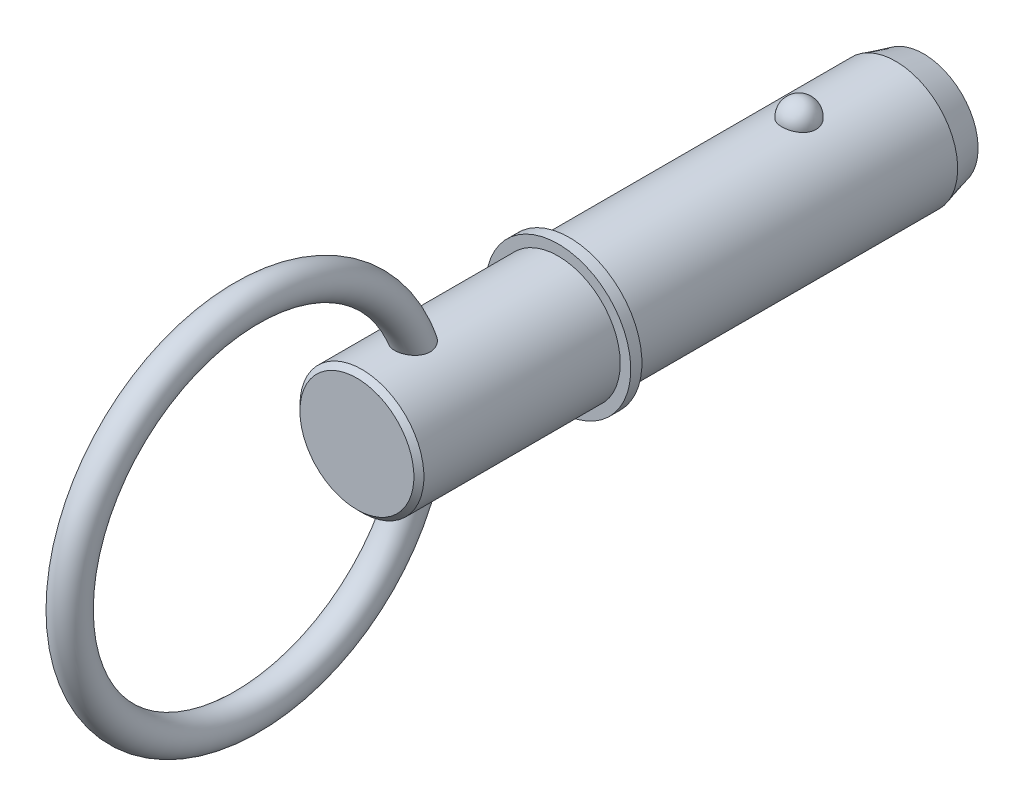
ISO-10303-21;
HEADER;
FILE_DESCRIPTION(('STEP AP214'),'2;1');
FILE_NAME('part.step','',(''),(''),'','','');
FILE_SCHEMA(('AUTOMOTIVE_DESIGN { 1 0 10303 214 1 1 1 1 }'));
ENDSEC;
DATA;
#1=APPLICATION_CONTEXT('core data for automotive mechanical design processes');
#2=APPLICATION_PROTOCOL_DEFINITION('international standard','automotive_design',2000,#1);
#3=PRODUCT_CONTEXT('',#1,'mechanical');
#4=PRODUCT('Part','Part','',(#3));
#5=PRODUCT_RELATED_PRODUCT_CATEGORY('part','',(#4));
#6=PRODUCT_DEFINITION_FORMATION('','',#4);
#7=PRODUCT_DEFINITION_CONTEXT('part definition',#1,'design');
#8=PRODUCT_DEFINITION('design','',#6,#7);
#9=PRODUCT_DEFINITION_SHAPE('','',#8);
#10=(LENGTH_UNIT() NAMED_UNIT(*) SI_UNIT(.MILLI.,.METRE.));
#11=(NAMED_UNIT(*) PLANE_ANGLE_UNIT() SI_UNIT($,.RADIAN.));
#12=(NAMED_UNIT(*) SI_UNIT($,.STERADIAN.) SOLID_ANGLE_UNIT());
#13=UNCERTAINTY_MEASURE_WITH_UNIT(LENGTH_MEASURE(1.E-05),#10,'distance_accuracy_value','');
#14=(GEOMETRIC_REPRESENTATION_CONTEXT(3) GLOBAL_UNCERTAINTY_ASSIGNED_CONTEXT((#13)) GLOBAL_UNIT_ASSIGNED_CONTEXT((#10,
#11,#12)) REPRESENTATION_CONTEXT('',''));
#15=CARTESIAN_POINT('',(0.,0.,0.));
#16=DIRECTION('',(0.,0.,1.));
#17=DIRECTION('',(1.,0.,0.));
#18=AXIS2_PLACEMENT_3D('',#15,#16,#17);
#19=CARTESIAN_POINT('',(0.,0.,38.1));
#20=DIRECTION('',(0.,0.,-1.));
#21=DIRECTION('',(-1.,0.,0.));
#22=AXIS2_PLACEMENT_3D('',#19,#20,#21);
#23=CYLINDRICAL_SURFACE('',#22,11.115);
#24=CARTESIAN_POINT('',(3.04058343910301,10.6910278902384,-3.07));
#25=CARTESIAN_POINT('',(3.04058039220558,10.6910304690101,-2.89837124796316));
#26=CARTESIAN_POINT('',(3.02657193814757,10.6950430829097,-2.72670368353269));
#27=CARTESIAN_POINT('',(2.97087341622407,10.7106465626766,-2.38822964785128));
#28=CARTESIAN_POINT('',(2.92917240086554,10.7222404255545,-2.22142512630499));
#29=CARTESIAN_POINT('',(2.81915317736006,10.751689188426,-1.89750816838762));
#30=CARTESIAN_POINT('',(2.75084669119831,10.7695413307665,-1.7403914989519));
#31=CARTESIAN_POINT('',(2.58932284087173,10.809510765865,-1.44013959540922));
#32=CARTESIAN_POINT('',(2.49610617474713,10.8316279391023,-1.29700396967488));
#33=CARTESIAN_POINT('',(2.28659317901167,10.877786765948,-1.02797591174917));
#34=CARTESIAN_POINT('',(2.17018825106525,10.9018371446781,-0.902169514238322));
#35=CARTESIAN_POINT('',(1.91759004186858,10.9490888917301,-0.67209160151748));
#36=CARTESIAN_POINT('',(1.78139672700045,10.9722902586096,-0.567820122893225));
#37=CARTESIAN_POINT('',(1.49327884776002,11.0151925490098,-0.383992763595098));
#38=CARTESIAN_POINT('',(1.34139928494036,11.034903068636,-0.304368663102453));
#39=CARTESIAN_POINT('',(1.0258482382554,11.0686948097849,-0.17173147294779));
#40=CARTESIAN_POINT('',(0.862178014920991,11.0827766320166,-0.118715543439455));
#41=CARTESIAN_POINT('',(0.530748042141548,11.1035404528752,-0.0415304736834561));
#42=CARTESIAN_POINT('',(0.363109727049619,11.1103474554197,-0.0168734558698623));
#43=CARTESIAN_POINT('',(0.0259327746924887,11.1162480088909,0.00453486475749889));
#44=CARTESIAN_POINT('',(-0.143605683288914,11.1153422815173,0.00128877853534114));
#45=CARTESIAN_POINT('',(-0.477280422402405,11.1059854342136,-0.0327676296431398));
#46=CARTESIAN_POINT('',(-0.6414590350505,11.0976393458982,-0.0631942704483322));
#47=CARTESIAN_POINT('',(-0.962236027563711,11.0744390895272,-0.150220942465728));
#48=CARTESIAN_POINT('',(-1.11883427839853,11.0595848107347,-0.206821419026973));
#49=CARTESIAN_POINT('',(-1.42104610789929,11.0248420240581,-0.34502889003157));
#50=CARTESIAN_POINT('',(-1.56659244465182,11.0049254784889,-0.426775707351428));
#51=CARTESIAN_POINT('',(-1.8418931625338,10.9622119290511,-0.612956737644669));
#52=CARTESIAN_POINT('',(-1.97164597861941,10.9394146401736,-0.717393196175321));
#53=CARTESIAN_POINT('',(-2.21432263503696,10.8929139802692,-0.948332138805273));
#54=CARTESIAN_POINT('',(-2.32688909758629,10.8692016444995,-1.07520847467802));
#55=CARTESIAN_POINT('',(-2.52940007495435,10.8238699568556,-1.34622145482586));
#56=CARTESIAN_POINT('',(-2.6193430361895,10.8022507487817,-1.49035928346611));
#57=CARTESIAN_POINT('',(-2.77523958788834,10.7632629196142,-1.79367507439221));
#58=CARTESIAN_POINT('',(-2.8409151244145,10.7459442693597,-1.95300253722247));
#59=CARTESIAN_POINT('',(-2.94519180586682,10.7178360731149,-2.28083009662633));
#60=CARTESIAN_POINT('',(-2.98379371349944,10.707046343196,-2.44932993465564));
#61=CARTESIAN_POINT('',(-3.03284665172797,10.6932559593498,-2.78998091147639));
#62=CARTESIAN_POINT('',(-3.04341313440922,10.6902233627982,-2.96211412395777));
#63=CARTESIAN_POINT('',(-3.03646037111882,10.6922002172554,-3.305762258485));
#64=CARTESIAN_POINT('',(-3.0189418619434,10.6972094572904,-3.47727719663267));
#65=CARTESIAN_POINT('',(-2.95641582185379,10.7146564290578,-3.81396465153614));
#66=CARTESIAN_POINT('',(-2.91154117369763,10.7270582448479,-3.97916375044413));
#67=CARTESIAN_POINT('',(-2.79553341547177,10.7578713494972,-4.29947360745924));
#68=CARTESIAN_POINT('',(-2.72439927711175,10.7762828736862,-4.45458397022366));
#69=CARTESIAN_POINT('',(-2.55718900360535,10.8171819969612,-4.75123550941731));
#70=CARTESIAN_POINT('',(-2.46098224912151,10.8396907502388,-4.89270014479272));
#71=CARTESIAN_POINT('',(-2.24623042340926,10.8862165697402,-5.15724095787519));
#72=CARTESIAN_POINT('',(-2.12768452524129,10.9102336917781,-5.28031645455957));
#73=CARTESIAN_POINT('',(-1.87085107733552,10.9571990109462,-5.5050961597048));
#74=CARTESIAN_POINT('',(-1.73249451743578,10.9801430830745,-5.60672245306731));
#75=CARTESIAN_POINT('',(-1.44010079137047,11.0223008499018,-5.78517789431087));
#76=CARTESIAN_POINT('',(-1.28606470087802,11.0415148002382,-5.86200874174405));
#77=CARTESIAN_POINT('',(-0.968615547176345,11.0738491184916,-5.98788441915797));
#78=CARTESIAN_POINT('',(-0.805339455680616,11.0870408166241,-6.03725610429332));
#79=CARTESIAN_POINT('',(-0.472449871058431,11.1062048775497,-6.10820004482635));
#80=CARTESIAN_POINT('',(-0.302837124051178,11.11217808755,-6.1297755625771));
#81=CARTESIAN_POINT('',(0.034576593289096,11.1162034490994,-6.1443619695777));
#82=CARTESIAN_POINT('',(0.202353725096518,11.1143988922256,-6.13788957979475));
#83=CARTESIAN_POINT('',(0.534364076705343,11.103390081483,-6.09773981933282));
#84=CARTESIAN_POINT('',(0.698597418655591,11.094186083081,-6.06406338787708));
#85=CARTESIAN_POINT('',(1.01830314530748,11.0694136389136,-5.97063285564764));
#86=CARTESIAN_POINT('',(1.17380497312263,11.0538682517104,-5.91097318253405));
#87=CARTESIAN_POINT('',(1.472484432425,11.0180608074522,-5.76723645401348));
#88=CARTESIAN_POINT('',(1.6156613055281,10.9977984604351,-5.68315789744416));
#89=CARTESIAN_POINT('',(1.88801614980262,10.9543574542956,-5.49138807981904));
#90=CARTESIAN_POINT('',(2.01695079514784,10.9311394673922,-5.38336024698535));
#91=CARTESIAN_POINT('',(2.25501495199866,10.8845248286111,-5.14733839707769));
#92=CARTESIAN_POINT('',(2.36414099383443,10.8611281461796,-5.01934088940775));
#93=CARTESIAN_POINT('',(2.56152595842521,10.8162958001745,-4.74447932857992));
#94=CARTESIAN_POINT('',(2.64940088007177,10.7948999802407,-4.59733288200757));
#95=CARTESIAN_POINT('',(2.79961494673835,10.7569242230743,-4.29001203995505));
#96=CARTESIAN_POINT('',(2.86196390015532,10.7403424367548,-4.12984267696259));
#97=CARTESIAN_POINT('',(2.95377333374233,10.715429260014,-3.82062342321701));
#98=CARTESIAN_POINT('',(2.98627018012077,10.7063495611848,-3.67252681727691));
#99=CARTESIAN_POINT('',(3.02967634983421,10.6941478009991,-3.37296350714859));
#100=CARTESIAN_POINT('',(3.04058612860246,10.6910256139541,-3.2214968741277));
#101=CARTESIAN_POINT('',(3.04058343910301,10.6910278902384,-3.07));
#102=B_SPLINE_CURVE_WITH_KNOTS('',3,(#24,#25,#26,#27,#28,#29,#30,#31,#32,#33,#34,#35,#36,#37,
#38,#39,#40,#41,#42,#43,#44,#45,#46,#47,#48,#49,#50,#51,#52,#53,#54,#55,#56,#57,#58,#59,#60,#61,
#62,#63,#64,#65,#66,#67,#68,#69,#70,#71,#72,#73,#74,#75,#76,#77,#78,#79,#80,#81,#82,#83,#84,#85,
#86,#87,#88,#89,#90,#91,#92,#93,#94,#95,#96,#97,#98,#99,#100,#101),.UNSPECIFIED.,.T.,.F.,(4,2,2,
2,2,2,2,2,2,2,2,2,2,2,2,2,2,2,2,2,2,2,2,2,2,2,2,2,2,2,2,2,2,2,2,2,2,2,4),(0.,0.514341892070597,
1.02888723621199,1.54320613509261,2.0575106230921,2.57428293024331,3.09105611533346,
3.60638589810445,4.1216606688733,4.62793159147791,5.1341551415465,5.63334381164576,
6.13254097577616,6.63456562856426,7.13663998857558,7.64804063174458,8.15947638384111,
8.6766026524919,9.19371435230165,9.70869321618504,10.223658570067,10.7361421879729,
11.2486458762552,11.7638748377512,12.2791228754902,12.7962115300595,13.3132647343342,
13.8240238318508,14.3347229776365,14.8360540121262,15.3373677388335,15.8368746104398,
16.3364121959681,16.8434736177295,17.3506237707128,17.8663484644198,18.3818748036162,
18.8358944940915,19.2899046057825),.UNSPECIFIED.);
#103=CARTESIAN_POINT('',(3.04058343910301,10.6910278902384,-3.07));
#104=VERTEX_POINT('',#103);
#105=EDGE_CURVE('E102',#104,#104,#102,.T.);
#106=ORIENTED_EDGE('',*,*,#105,.T.);
#107=EDGE_LOOP('',(#106));
#108=FACE_BOUND('',#107,.T.);
#109=CARTESIAN_POINT('',(0.,0.,-20.4));
#110=DIRECTION('',(0.,0.,-1.));
#111=DIRECTION('',(-1.,0.,0.));
#112=AXIS2_PLACEMENT_3D('',#109,#110,#111);
#113=CIRCLE('',#112,11.115);
#114=CARTESIAN_POINT('',(-11.115,0.,-20.4));
#115=VERTEX_POINT('',#114);
#116=EDGE_CURVE('E110',#115,#115,#113,.F.);
#117=ORIENTED_EDGE('',*,*,#116,.T.);
#118=EDGE_LOOP('',(#117));
#119=FACE_BOUND('',#118,.T.);
#120=CARTESIAN_POINT('',(0.,0.,38.1));
#121=DIRECTION('',(0.,0.,1.));
#122=DIRECTION('',(1.,0.,0.));
#123=AXIS2_PLACEMENT_3D('',#120,#121,#122);
#124=CIRCLE('',#123,11.115);
#125=CARTESIAN_POINT('',(11.115,0.,38.1));
#126=VERTEX_POINT('',#125);
#127=EDGE_CURVE('E108',#126,#126,#124,.T.);
#128=ORIENTED_EDGE('',*,*,#127,.F.);
#129=EDGE_LOOP('',(#128));
#130=FACE_BOUND('',#129,.T.);
#131=ADVANCED_FACE('F39',(#108,#119,#130),#23,.T.);
#132=CARTESIAN_POINT('',(0.,0.,-25.4));
#133=DIRECTION('',(0.,0.,-1.));
#134=DIRECTION('',(-1.,0.,0.));
#135=AXIS2_PLACEMENT_3D('',#132,#133,#134);
#136=PLANE('',#135);
#137=CARTESIAN_POINT('',(0.,0.,-25.4));
#138=DIRECTION('',(0.,0.,-1.));
#139=DIRECTION('',(-1.,0.,0.));
#140=AXIS2_PLACEMENT_3D('',#137,#138,#139);
#141=CIRCLE('',#140,9.7752540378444);
#142=CARTESIAN_POINT('',(-9.7752540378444,0.,-25.4));
#143=VERTEX_POINT('',#142);
#144=EDGE_CURVE('E142',#143,#143,#141,.T.);
#145=ORIENTED_EDGE('',*,*,#144,.T.);
#146=EDGE_LOOP('',(#145));
#147=FACE_BOUND('',#146,.T.);
#148=ADVANCED_FACE('F88',(#147),#136,.T.);
#149=CARTESIAN_POINT('',(0.,0.,-25.4));
#150=DIRECTION('',(0.,0.,1.));
#151=DIRECTION('',(1.,0.,0.));
#152=AXIS2_PLACEMENT_3D('',#149,#150,#151);
#153=CONICAL_SURFACE('',#152,9.7752540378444,0.261799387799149);
#154=ORIENTED_EDGE('',*,*,#116,.F.);
#155=EDGE_LOOP('',(#154));
#156=FACE_BOUND('',#155,.T.);
#157=ORIENTED_EDGE('',*,*,#144,.F.);
#158=EDGE_LOOP('',(#157));
#159=FACE_BOUND('',#158,.T.);
#160=ADVANCED_FACE('F94',(#156,#159),#153,.T.);
#161=CARTESIAN_POINT('',(0.,11.115,-3.07));
#162=DIRECTION('',(0.,1.,0.));
#163=DIRECTION('',(0.,0.,1.));
#164=AXIS2_PLACEMENT_3D('',#161,#162,#163);
#165=SPHERICAL_SURFACE('',#164,3.07);
#166=ORIENTED_EDGE('',*,*,#105,.F.);
#167=EDGE_LOOP('',(#166));
#168=FACE_BOUND('',#167,.T.);
#169=ADVANCED_FACE('F113',(#168),#165,.T.);
#170=CARTESIAN_POINT('',(0.,0.,38.1));
#171=DIRECTION('',(0.,0.,-1.));
#172=DIRECTION('',(-1.,0.,0.));
#173=AXIS2_PLACEMENT_3D('',#170,#171,#172);
#174=PLANE('',#173);
#175=ORIENTED_EDGE('',*,*,#127,.T.);
#176=EDGE_LOOP('',(#175));
#177=FACE_BOUND('',#176,.T.);
#178=CARTESIAN_POINT('',(0.,0.,38.1));
#179=DIRECTION('',(0.,0.,-1.));
#180=DIRECTION('',(-1.,0.,0.));
#181=AXIS2_PLACEMENT_3D('',#178,#179,#180);
#182=CIRCLE('',#181,13.);
#183=CARTESIAN_POINT('',(-13.,0.,38.1));
#184=VERTEX_POINT('',#183);
#185=EDGE_CURVE('E109',#184,#184,#182,.T.);
#186=ORIENTED_EDGE('',*,*,#185,.T.);
#187=EDGE_LOOP('',(#186));
#188=FACE_BOUND('',#187,.T.);
#189=ADVANCED_FACE('F117',(#177,#188),#174,.T.);
#190=CARTESIAN_POINT('',(0.,0.,33.7287874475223));
#191=DIRECTION('',(0.,0.,-1.));
#192=DIRECTION('',(-1.,0.,0.));
#193=AXIS2_PLACEMENT_3D('',#190,#191,#192);
#194=CYLINDRICAL_SURFACE('',#193,13.);
#195=CARTESIAN_POINT('',(0.,0.,40.1));
#196=DIRECTION('',(0.,0.,-1.));
#197=DIRECTION('',(-1.,0.,0.));
#198=AXIS2_PLACEMENT_3D('',#195,#196,#197);
#199=CIRCLE('',#198,13.);
#200=CARTESIAN_POINT('',(-13.,0.,40.1));
#201=VERTEX_POINT('',#200);
#202=EDGE_CURVE('E134',#201,#201,#199,.T.);
#203=ORIENTED_EDGE('',*,*,#202,.T.);
#204=EDGE_LOOP('',(#203));
#205=FACE_BOUND('',#204,.T.);
#206=ORIENTED_EDGE('',*,*,#185,.F.);
#207=EDGE_LOOP('',(#206));
#208=FACE_BOUND('',#207,.T.);
#209=ADVANCED_FACE('F121',(#205,#208),#194,.T.);
#210=CARTESIAN_POINT('',(0.,13.,40.1));
#211=DIRECTION('',(0.,0.,1.));
#212=DIRECTION('',(1.,0.,0.));
#213=AXIS2_PLACEMENT_3D('',#210,#211,#212);
#214=PLANE('',#213);
#215=CARTESIAN_POINT('',(0.,0.,40.1));
#216=DIRECTION('',(0.,0.,1.));
#217=DIRECTION('',(1.,0.,0.));
#218=AXIS2_PLACEMENT_3D('',#215,#216,#217);
#219=CIRCLE('',#218,11.115);
#220=CARTESIAN_POINT('',(11.115,0.,40.1));
#221=VERTEX_POINT('',#220);
#222=EDGE_CURVE('E112',#221,#221,#219,.T.);
#223=ORIENTED_EDGE('',*,*,#222,.F.);
#224=EDGE_LOOP('',(#223));
#225=FACE_BOUND('',#224,.T.);
#226=ORIENTED_EDGE('',*,*,#202,.F.);
#227=EDGE_LOOP('',(#226));
#228=FACE_BOUND('',#227,.T.);
#229=ADVANCED_FACE('F85',(#225,#228),#214,.T.);
#230=CARTESIAN_POINT('',(0.,0.,76.2));
#231=DIRECTION('',(0.,0.,-1.));
#232=DIRECTION('',(-1.,0.,0.));
#233=AXIS2_PLACEMENT_3D('',#230,#231,#232);
#234=CYLINDRICAL_SURFACE('',#233,11.115);
#235=CARTESIAN_POINT('',(-1.22435852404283,-11.0473603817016,63.2784197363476));
#236=CARTESIAN_POINT('',(-1.07078016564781,-11.0643805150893,63.2116991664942));
#237=CARTESIAN_POINT('',(-0.911372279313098,-11.0787777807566,63.1577454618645));
#238=CARTESIAN_POINT('',(-0.585451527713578,-11.1007717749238,63.0765522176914));
#239=CARTESIAN_POINT('',(-0.418938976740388,-11.1083688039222,63.0493114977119));
#240=CARTESIAN_POINT('',(-0.0835394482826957,-11.1159515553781,63.0221212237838));
#241=CARTESIAN_POINT('',(0.085347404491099,-11.1159376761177,63.0221702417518));
#242=CARTESIAN_POINT('',(0.420723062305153,-11.1083011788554,63.0495547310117));
#243=CARTESIAN_POINT('',(0.587211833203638,-11.1006784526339,63.0768905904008));
#244=CARTESIAN_POINT('',(0.91318995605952,-11.0786293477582,63.1582995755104));
#245=CARTESIAN_POINT('',(1.07267378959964,-11.0641977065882,63.2123933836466));
#246=CARTESIAN_POINT('',(1.37994044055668,-11.0300907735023,63.3461408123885));
#247=CARTESIAN_POINT('',(1.52772335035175,-11.0104155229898,63.4257942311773));
#248=CARTESIAN_POINT('',(1.80679367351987,-10.9680716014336,63.6084678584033));
#249=CARTESIAN_POINT('',(1.93814041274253,-10.945414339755,63.7114000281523));
#250=CARTESIAN_POINT('',(2.18117403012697,-10.8995884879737,63.938212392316));
#251=CARTESIAN_POINT('',(2.29286356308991,-10.8764199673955,64.0620897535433));
#252=CARTESIAN_POINT('',(2.49238969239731,-10.8324319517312,64.3259926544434));
#253=CARTESIAN_POINT('',(2.58046870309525,-10.8115899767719,64.4658312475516));
#254=CARTESIAN_POINT('',(2.73218762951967,-10.7742522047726,64.7586913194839));
#255=CARTESIAN_POINT('',(2.7958294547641,-10.757756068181,64.9117117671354));
#256=CARTESIAN_POINT('',(2.89767977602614,-10.7307723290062,65.2266092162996));
#257=CARTESIAN_POINT('',(2.93586554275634,-10.7202900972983,65.3884939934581));
#258=CARTESIAN_POINT('',(2.98678800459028,-10.7062139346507,65.7164805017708));
#259=CARTESIAN_POINT('',(2.99951894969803,-10.7026215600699,65.8825831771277));
#260=CARTESIAN_POINT('',(3.0004780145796,-10.7023530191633,66.2232270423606));
#261=CARTESIAN_POINT('',(2.98743421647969,-10.7060358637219,66.3977701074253));
#262=CARTESIAN_POINT('',(2.93592917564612,-10.7202719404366,66.7427508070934));
#263=CARTESIAN_POINT('',(2.8974582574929,-10.7308277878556,66.9131868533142));
#264=CARTESIAN_POINT('',(2.79180512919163,-10.7588257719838,67.2631149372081));
#265=CARTESIAN_POINT('',(2.72213928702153,-10.776850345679,67.4418115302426));
#266=CARTESIAN_POINT('',(2.55612841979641,-10.8174264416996,67.7859744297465));
#267=CARTESIAN_POINT('',(2.45975697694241,-10.8399824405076,67.9514274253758));
#268=CARTESIAN_POINT('',(2.23434632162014,-10.8887625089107,68.275672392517));
#269=CARTESIAN_POINT('',(2.10349593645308,-10.9151327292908,68.4331925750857));
#270=CARTESIAN_POINT('',(1.81505097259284,-10.96677510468,68.7216682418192));
#271=CARTESIAN_POINT('',(1.65749731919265,-10.9920488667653,68.8526637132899));
#272=CARTESIAN_POINT('',(1.36197799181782,-11.0319737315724,69.0513134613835));
#273=CARTESIAN_POINT('',(1.22927684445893,-11.0476896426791,69.1266009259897));
#274=CARTESIAN_POINT('',(0.952979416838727,-11.0749380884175,69.2545744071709));
#275=CARTESIAN_POINT('',(0.809393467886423,-11.0864745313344,69.3072815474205));
#276=CARTESIAN_POINT('',(0.513954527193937,-11.1041011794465,69.3870588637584));
#277=CARTESIAN_POINT('',(0.362058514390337,-11.1101594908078,69.4139789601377));
#278=CARTESIAN_POINT('',(0.0557792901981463,-11.1159132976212,69.4395595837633));
#279=CARTESIAN_POINT('',(-0.0986030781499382,-11.1156109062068,69.4382294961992));
#280=CARTESIAN_POINT('',(-0.389768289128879,-11.1090283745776,69.4089352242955));
#281=CARTESIAN_POINT('',(-0.526830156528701,-11.1033186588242,69.3835124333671));
#282=CARTESIAN_POINT('',(-0.794878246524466,-11.0873547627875,69.3112701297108));
#283=CARTESIAN_POINT('',(-0.925863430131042,-11.0770998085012,69.2644469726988));
#284=CARTESIAN_POINT('',(-1.18354406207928,-11.0525934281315,69.1498438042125));
#285=CARTESIAN_POINT('',(-1.30991621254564,-11.0382116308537,69.0813711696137));
#286=CARTESIAN_POINT('',(-1.55122352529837,-11.0068962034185,68.9271312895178));
#287=CARTESIAN_POINT('',(-1.66615377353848,-10.9899614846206,68.8413566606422));
#288=CARTESIAN_POINT('',(-1.90024050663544,-10.9520991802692,68.6408720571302));
#289=CARTESIAN_POINT('',(-2.01728342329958,-10.9309598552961,68.5237372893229));
#290=CARTESIAN_POINT('',(-2.23333659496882,-10.8888735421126,68.2738397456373));
#291=CARTESIAN_POINT('',(-2.33233396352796,-10.8679267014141,68.1410659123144));
#292=CARTESIAN_POINT('',(-2.52607041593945,-10.8246766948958,67.8400006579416));
#293=CARTESIAN_POINT('',(-2.61741570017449,-10.8027194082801,67.6694627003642));
#294=CARTESIAN_POINT('',(-2.77251687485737,-10.7639568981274,67.3156715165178));
#295=CARTESIAN_POINT('',(-2.8362578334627,-10.7471544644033,67.1324114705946));
#296=CARTESIAN_POINT('',(-2.93668505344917,-10.7201706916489,66.7466242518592));
#297=CARTESIAN_POINT('',(-2.97161961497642,-10.7104219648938,66.543594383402));
#298=CARTESIAN_POINT('',(-2.99683495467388,-10.7033740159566,66.2368749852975));
#299=CARTESIAN_POINT('',(-3.00070536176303,-10.7022882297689,66.1342341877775));
#300=CARTESIAN_POINT('',(-2.99908594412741,-10.7027439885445,65.9290499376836));
#301=CARTESIAN_POINT('',(-2.99360154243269,-10.7042840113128,65.8265064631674));
#302=CARTESIAN_POINT('',(-2.97382504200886,-10.7097936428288,65.6303300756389));
#303=CARTESIAN_POINT('',(-2.9602439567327,-10.7135669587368,65.5366192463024));
#304=CARTESIAN_POINT('',(-2.92480741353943,-10.723295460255,65.350932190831));
#305=CARTESIAN_POINT('',(-2.90295619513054,-10.7292495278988,65.2589551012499));
#306=CARTESIAN_POINT('',(-2.8509700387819,-10.7431800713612,65.0775474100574));
#307=CARTESIAN_POINT('',(-2.82083748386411,-10.7511559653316,64.9881160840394));
#308=CARTESIAN_POINT('',(-2.75241691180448,-10.7688750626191,64.8126453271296));
#309=CARTESIAN_POINT('',(-2.71412954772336,-10.7786181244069,64.7266056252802));
#310=CARTESIAN_POINT('',(-2.59550576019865,-10.807996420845,64.4910554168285));
#311=CARTESIAN_POINT('',(-2.50612224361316,-10.8292837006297,64.3461731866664));
#312=CARTESIAN_POINT('',(-2.30366035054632,-10.8741467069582,64.0745713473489));
#313=CARTESIAN_POINT('',(-2.19058370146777,-10.8977222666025,63.9478504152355));
#314=CARTESIAN_POINT('',(-1.94442412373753,-10.9443154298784,63.7164621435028));
#315=CARTESIAN_POINT('',(-1.81141354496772,-10.967334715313,63.6117182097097));
#316=CARTESIAN_POINT('',(-1.529042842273,-11.0102504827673,63.4264358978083));
#317=CARTESIAN_POINT('',(-1.37968206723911,-11.0301468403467,63.3458984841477));
#318=CARTESIAN_POINT('',(-1.22435852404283,-11.0473603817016,63.2784197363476));
#319=B_SPLINE_CURVE_WITH_KNOTS('',3,(#235,#236,#237,#238,#239,#240,#241,#242,#243,#244,#245,
#246,#247,#248,#249,#250,#251,#252,#253,#254,#255,#256,#257,#258,#259,#260,#261,#262,#263,#264,
#265,#266,#267,#268,#269,#270,#271,#272,#273,#274,#275,#276,#277,#278,#279,#280,#281,#282,#283,
#284,#285,#286,#287,#288,#289,#290,#291,#292,#293,#294,#295,#296,#297,#298,#299,#300,#301,#302,
#303,#304,#305,#306,#307,#308,#309,#310,#311,#312,#313,#314,#315,#316,#317,#318),.UNSPECIFIED.,
.T.,.F.,(4,2,2,2,2,2,2,2,2,2,2,2,2,2,2,2,2,2,2,2,2,2,2,2,2,2,2,2,2,2,2,2,2,2,2,2,2,2,2,2,2,4),
(0.,0.504317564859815,1.00861284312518,1.51288173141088,2.01715779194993,2.52182424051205,
3.02648670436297,3.52927157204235,4.03198848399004,4.52932690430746,5.02662645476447,
5.5243694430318,6.0222248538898,6.545261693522,7.06849767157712,7.64398785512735,
8.22004937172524,8.83633461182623,9.45168373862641,9.90997173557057,10.3678300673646,
10.8283372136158,11.2886913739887,11.7053264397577,12.1220324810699,12.5537129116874,
12.9855779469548,13.4844842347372,13.9837454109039,14.5653303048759,15.1472294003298,
15.762338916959,16.0701226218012,16.3777279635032,16.6616380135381,16.9454027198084,
17.229085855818,17.5127462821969,18.0246262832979,18.5364689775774,19.0464970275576,
19.5565453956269),.UNSPECIFIED.);
#320=CARTESIAN_POINT('',(-1.22435852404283,-11.0473603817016,63.2784197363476));
#321=VERTEX_POINT('',#320);
#322=EDGE_CURVE('E10',#321,#321,#319,.T.);
#323=ORIENTED_EDGE('',*,*,#322,.F.);
#324=EDGE_LOOP('',(#323));
#325=FACE_BOUND('',#324,.T.);
#326=CARTESIAN_POINT('',(-1.22435852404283,11.0473603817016,63.2784197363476));
#327=CARTESIAN_POINT('',(-1.37630771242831,11.0305212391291,63.344431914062));
#328=CARTESIAN_POINT('',(-1.52254325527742,11.0111158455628,63.4229381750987));
#329=CARTESIAN_POINT('',(-1.79945383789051,10.9692671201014,63.6031533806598));
#330=CARTESIAN_POINT('',(-1.93013010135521,10.9468240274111,63.7048604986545));
#331=CARTESIAN_POINT('',(-2.17227655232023,10.9013603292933,63.9290359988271));
#332=CARTESIAN_POINT('',(-2.28373752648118,10.8783394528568,64.0515142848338));
#333=CARTESIAN_POINT('',(-2.48427458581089,10.8343057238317,64.3138954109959));
#334=CARTESIAN_POINT('',(-2.57335330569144,10.8132926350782,64.4537961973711));
#335=CARTESIAN_POINT('',(-2.7264007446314,10.7757209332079,64.7459648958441));
#336=CARTESIAN_POINT('',(-2.79054231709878,10.7591319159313,64.8981385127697));
#337=CARTESIAN_POINT('',(-2.89354234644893,10.7318913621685,65.2112862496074));
#338=CARTESIAN_POINT('',(-2.93239912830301,10.7212402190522,65.3722609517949));
#339=CARTESIAN_POINT('',(-2.98540436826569,10.7066038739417,65.7019559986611));
#340=CARTESIAN_POINT('',(-2.9990165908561,10.7027634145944,65.8707680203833));
#341=CARTESIAN_POINT('',(-3.0008814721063,10.7022388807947,66.2085087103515));
#342=CARTESIAN_POINT('',(-2.98912652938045,10.7055569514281,66.3774373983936));
#343=CARTESIAN_POINT('',(-2.93985175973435,10.7191979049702,66.7248560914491));
#344=CARTESIAN_POINT('',(-2.90036626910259,10.7300544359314,66.9030445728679));
#345=CARTESIAN_POINT('',(-2.7955500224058,10.7578360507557,67.2512150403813));
#346=CARTESIAN_POINT('',(-2.73019988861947,10.774765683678,67.4211907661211));
#347=CARTESIAN_POINT('',(-2.56762574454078,10.8147227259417,67.7657841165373));
#348=CARTESIAN_POINT('',(-2.46786230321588,10.838191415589,67.9391574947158));
#349=CARTESIAN_POINT('',(-2.24100420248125,10.8873575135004,68.2666868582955));
#350=CARTESIAN_POINT('',(-2.11391925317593,10.9130541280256,68.4208496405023));
#351=CARTESIAN_POINT('',(-1.85542700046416,10.9597063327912,68.6827355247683));
#352=CARTESIAN_POINT('',(-1.72758345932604,10.9807909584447,68.7939559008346));
#353=CARTESIAN_POINT('',(-1.45489931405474,11.0202250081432,68.9941223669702));
#354=CARTESIAN_POINT('',(-1.31006770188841,11.0385758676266,69.0830801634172));
#355=CARTESIAN_POINT('',(-1.08171164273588,11.0625084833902,69.1963702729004));
#356=CARTESIAN_POINT('',(-1.0033223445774,11.069914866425,69.2308967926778));
#357=CARTESIAN_POINT('',(-0.843525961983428,11.0832350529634,69.2923914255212));
#358=CARTESIAN_POINT('',(-0.762120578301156,11.0891496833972,69.3193637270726));
#359=CARTESIAN_POINT('',(-0.597014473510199,11.0992628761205,69.3651819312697));
#360=CARTESIAN_POINT('',(-0.513315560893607,11.1034627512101,69.3840340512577));
#361=CARTESIAN_POINT('',(-0.344374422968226,11.1099851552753,69.4132096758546));
#362=CARTESIAN_POINT('',(-0.259132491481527,11.1123080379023,69.4235347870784));
#363=CARTESIAN_POINT('',(-0.100838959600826,11.114780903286,69.4345196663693));
#364=CARTESIAN_POINT('',(-0.0278735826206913,11.1152042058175,69.436395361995));
#365=CARTESIAN_POINT('',(0.117962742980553,11.1146132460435,69.4337734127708));
#366=CARTESIAN_POINT('',(0.190833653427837,11.1135985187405,69.4292737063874));
#367=CARTESIAN_POINT('',(0.335842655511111,11.110161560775,69.4139786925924));
#368=CARTESIAN_POINT('',(0.407981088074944,11.1077400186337,69.4031864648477));
#369=CARTESIAN_POINT('',(0.551029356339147,11.1015643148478,69.375503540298));
#370=CARTESIAN_POINT('',(0.621938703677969,11.0978096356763,69.3586104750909));
#371=CARTESIAN_POINT('',(0.825381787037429,11.0851145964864,69.3010547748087));
#372=CARTESIAN_POINT('',(0.955713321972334,11.0745538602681,69.2527059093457));
#373=CARTESIAN_POINT('',(1.20733127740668,11.0499605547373,69.1373252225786));
#374=CARTESIAN_POINT('',(1.328615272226,11.0359270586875,69.0702884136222));
#375=CARTESIAN_POINT('',(1.57344360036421,11.0038352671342,68.9118439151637));
#376=CARTESIAN_POINT('',(1.69572941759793,10.9855025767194,68.8185512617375));
#377=CARTESIAN_POINT('',(1.92565215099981,10.9475431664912,68.6156505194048));
#378=CARTESIAN_POINT('',(2.03328016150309,10.9279156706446,68.5060325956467));
#379=CARTESIAN_POINT('',(2.25048911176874,10.8854412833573,68.2529911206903));
#380=CARTESIAN_POINT('',(2.35710396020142,10.8626332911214,68.1070101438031));
#381=CARTESIAN_POINT('',(2.54757318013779,10.8195493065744,67.800478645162));
#382=CARTESIAN_POINT('',(2.63141052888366,10.799275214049,67.6399173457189));
#383=CARTESIAN_POINT('',(2.78342312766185,10.7611645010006,67.2878272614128));
#384=CARTESIAN_POINT('',(2.84851472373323,10.7439117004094,67.0948938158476));
#385=CARTESIAN_POINT('',(2.9456265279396,10.7177011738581,66.7001309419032));
#386=CARTESIAN_POINT('',(2.97764942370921,10.7087427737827,66.4983022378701));
#387=CARTESIAN_POINT('',(2.99864828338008,10.7028651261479,66.1959897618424));
#388=CARTESIAN_POINT('',(3.00125529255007,10.7021342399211,66.0963789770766));
#389=CARTESIAN_POINT('',(2.9976304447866,10.7031517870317,65.8973450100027));
#390=CARTESIAN_POINT('',(2.99140295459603,10.704898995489,65.7979217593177));
#391=CARTESIAN_POINT('',(2.96990080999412,10.710883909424,65.6001790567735));
#392=CARTESIAN_POINT('',(2.95463019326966,10.7151205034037,65.5018591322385));
#393=CARTESIAN_POINT('',(2.91493260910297,10.7259879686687,65.3072196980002));
#394=CARTESIAN_POINT('',(2.89050674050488,10.7326185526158,65.2108999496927));
#395=CARTESIAN_POINT('',(2.83556656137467,10.7472556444,65.0312221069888));
#396=CARTESIAN_POINT('',(2.80596337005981,10.7550439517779,64.9475666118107));
#397=CARTESIAN_POINT('',(2.73953102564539,10.7721572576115,64.7833000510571));
#398=CARTESIAN_POINT('',(2.70269935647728,10.7814827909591,64.7026900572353));
#399=CARTESIAN_POINT('',(2.62203440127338,10.801383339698,64.5452733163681));
#400=CARTESIAN_POINT('',(2.57820565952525,10.8119575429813,64.4684641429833));
#401=CARTESIAN_POINT('',(2.48382482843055,10.8340293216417,64.3192237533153));
#402=CARTESIAN_POINT('',(2.43327032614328,10.8455272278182,64.246794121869));
#403=CARTESIAN_POINT('',(2.27895739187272,10.879345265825,64.0459926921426));
#404=CARTESIAN_POINT('',(2.1671718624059,10.9023791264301,63.9237643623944));
#405=CARTESIAN_POINT('',(1.92442677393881,10.9478318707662,63.7001515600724));
#406=CARTESIAN_POINT('',(1.79346836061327,10.9702507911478,63.598765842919));
#407=CARTESIAN_POINT('',(1.51657151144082,11.0119360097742,63.4195646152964));
#408=CARTESIAN_POINT('',(1.37069187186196,11.0312139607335,63.3416610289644));
#409=CARTESIAN_POINT('',(1.06764402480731,11.0646548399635,63.2106801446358));
#410=CARTESIAN_POINT('',(0.910475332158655,11.0788175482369,63.1576039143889));
#411=CARTESIAN_POINT('',(0.587492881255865,11.1006548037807,63.07697871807));
#412=CARTESIAN_POINT('',(0.421604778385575,11.1082585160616,63.0497081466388));
#413=CARTESIAN_POINT('',(0.0874262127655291,11.1159127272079,63.0222592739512));
#414=CARTESIAN_POINT('',(-0.0808643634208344,11.1159628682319,63.0220822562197));
#415=CARTESIAN_POINT('',(-0.416252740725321,11.1084780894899,63.0489180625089));
#416=CARTESIAN_POINT('',(-0.583334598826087,11.1008914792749,63.076116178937));
#417=CARTESIAN_POINT('',(-0.91035502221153,11.0788693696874,63.1574015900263));
#418=CARTESIAN_POINT('',(-1.07029370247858,11.064433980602,63.2114884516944));
#419=CARTESIAN_POINT('',(-1.22435852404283,11.0473603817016,63.2784197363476));
#420=B_SPLINE_CURVE_WITH_KNOTS('',3,(#326,#327,#328,#329,#330,#331,#332,#333,#334,#335,#336,
#337,#338,#339,#340,#341,#342,#343,#344,#345,#346,#347,#348,#349,#350,#351,#352,#353,#354,#355,
#356,#357,#358,#359,#360,#361,#362,#363,#364,#365,#366,#367,#368,#369,#370,#371,#372,#373,#374,
#375,#376,#377,#378,#379,#380,#381,#382,#383,#384,#385,#386,#387,#388,#389,#390,#391,#392,#393,
#394,#395,#396,#397,#398,#399,#400,#401,#402,#403,#404,#405,#406,#407,#408,#409,#410,#411,#412,
#413,#414,#415,#416,#417,#418,#419),.UNSPECIFIED.,.T.,.F.,(4,2,2,2,2,2,2,2,2,2,2,2,2,2,2,2,2,2,
2,2,2,2,2,2,2,2,2,2,2,2,2,2,2,2,2,2,2,2,2,2,2,2,2,2,2,2,4),(0.,0.498977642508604,
0.997916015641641,1.49709295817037,1.99621111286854,2.4918051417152,2.98743199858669,
3.49347125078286,3.99966216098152,4.54591839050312,5.09258465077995,5.69407889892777,
6.29535972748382,6.80565832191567,7.31568801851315,7.57328514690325,7.83073916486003,
8.08799570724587,8.34520376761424,8.5638916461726,8.78265025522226,9.00130188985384,
9.22003849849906,9.63638938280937,10.0528514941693,10.5157946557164,10.9790178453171,
11.5234572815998,12.0683024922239,12.6784825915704,13.288613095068,13.5872082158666,
13.8856557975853,14.1839702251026,14.482248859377,14.7491407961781,15.016125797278,
15.2829381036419,15.5498463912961,16.0489312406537,16.5479862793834,17.0451454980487,
17.542326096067,18.0448111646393,18.5473200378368,19.0532532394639,19.5591782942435),.UNSPECIFIED.);
#421=CARTESIAN_POINT('',(-1.22435852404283,11.0473603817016,63.2784197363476));
#422=VERTEX_POINT('',#421);
#423=EDGE_CURVE('E51',#422,#422,#420,.T.);
#424=ORIENTED_EDGE('',*,*,#423,.F.);
#425=EDGE_LOOP('',(#424));
#426=FACE_BOUND('',#425,.T.);
#427=CARTESIAN_POINT('',(0.,0.,75.3));
#428=DIRECTION('',(0.,0.,-1.));
#429=DIRECTION('',(-1.,0.,0.));
#430=AXIS2_PLACEMENT_3D('',#427,#428,#429);
#431=CIRCLE('',#430,11.115);
#432=CARTESIAN_POINT('',(-11.115,0.,75.3));
#433=VERTEX_POINT('',#432);
#434=EDGE_CURVE('E64',#433,#433,#431,.T.);
#435=ORIENTED_EDGE('',*,*,#434,.T.);
#436=EDGE_LOOP('',(#435));
#437=FACE_BOUND('',#436,.T.);
#438=ORIENTED_EDGE('',*,*,#222,.T.);
#439=EDGE_LOOP('',(#438));
#440=FACE_BOUND('',#439,.T.);
#441=ADVANCED_FACE('F69',(#325,#426,#437,#440),#234,.T.);
#442=CARTESIAN_POINT('',(0.,0.,76.2));
#443=DIRECTION('',(0.,0.,-1.));
#444=DIRECTION('',(-1.,0.,0.));
#445=AXIS2_PLACEMENT_3D('',#442,#443,#444);
#446=PLANE('',#445);
#447=CARTESIAN_POINT('',(0.,0.,76.2));
#448=DIRECTION('',(0.,0.,-1.));
#449=DIRECTION('',(-1.,0.,0.));
#450=AXIS2_PLACEMENT_3D('',#447,#448,#449);
#451=CIRCLE('',#450,10.215);
#452=CARTESIAN_POINT('',(-10.215,0.,76.2));
#453=VERTEX_POINT('',#452);
#454=EDGE_CURVE('E58',#453,#453,#451,.F.);
#455=ORIENTED_EDGE('',*,*,#454,.T.);
#456=EDGE_LOOP('',(#455));
#457=FACE_BOUND('',#456,.T.);
#458=ADVANCED_FACE('F76',(#457),#446,.F.);
#459=CARTESIAN_POINT('',(0.,0.,75.3));
#460=DIRECTION('',(0.,0.,-1.));
#461=DIRECTION('',(-1.,0.,0.));
#462=AXIS2_PLACEMENT_3D('',#459,#460,#461);
#463=CONICAL_SURFACE('',#462,11.115,0.785398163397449);
#464=ORIENTED_EDGE('',*,*,#454,.F.);
#465=EDGE_LOOP('',(#464));
#466=FACE_BOUND('',#465,.T.);
#467=ORIENTED_EDGE('',*,*,#434,.F.);
#468=EDGE_LOOP('',(#467));
#469=FACE_BOUND('',#468,.T.);
#470=ADVANCED_FACE('F41',(#466,#469),#463,.T.);
#471=CARTESIAN_POINT('',(0.,0.,95.95));
#472=DIRECTION('',(1.,0.,0.));
#473=DIRECTION('',(0.,0.,-1.));
#474=AXIS2_PLACEMENT_3D('',#471,#472,#473);
#475=TOROIDAL_SURFACE('',#474,31.75,3.);
#476=ORIENTED_EDGE('',*,*,#322,.T.);
#477=EDGE_LOOP('',(#476));
#478=FACE_BOUND('',#477,.T.);
#479=ORIENTED_EDGE('',*,*,#423,.T.);
#480=EDGE_LOOP('',(#479));
#481=FACE_BOUND('',#480,.T.);
#482=ADVANCED_FACE('F73',(#478,#481),#475,.T.);
#483=CLOSED_SHELL('',(#131,#148,#160,#169,#189,#209,#229,#441,#458,#470,#482));
#484=MANIFOLD_SOLID_BREP('B2',#483);
#485=ADVANCED_BREP_SHAPE_REPRESENTATION('',(#18,#484),#14);
#486=SHAPE_DEFINITION_REPRESENTATION(#9,#485);
ENDSEC;
END-ISO-10303-21;
